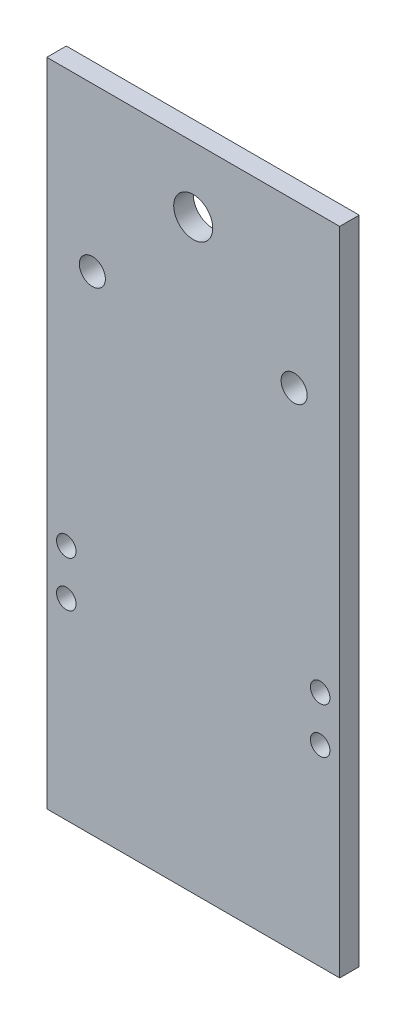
ISO-10303-21;
HEADER;
FILE_DESCRIPTION(('STEP AP214'),'2;1');
FILE_NAME('part.step','',(''),(''),'','','');
FILE_SCHEMA(('AUTOMOTIVE_DESIGN { 1 0 10303 214 1 1 1 1 }'));
ENDSEC;
DATA;
#1=APPLICATION_CONTEXT('core data for automotive mechanical design processes');
#2=APPLICATION_PROTOCOL_DEFINITION('international standard','automotive_design',2000,#1);
#3=PRODUCT_CONTEXT('',#1,'mechanical');
#4=PRODUCT('Part','Part','',(#3));
#5=PRODUCT_RELATED_PRODUCT_CATEGORY('part','',(#4));
#6=PRODUCT_DEFINITION_FORMATION('','',#4);
#7=PRODUCT_DEFINITION_CONTEXT('part definition',#1,'design');
#8=PRODUCT_DEFINITION('design','',#6,#7);
#9=PRODUCT_DEFINITION_SHAPE('','',#8);
#10=(LENGTH_UNIT() NAMED_UNIT(*) SI_UNIT(.MILLI.,.METRE.));
#11=(NAMED_UNIT(*) PLANE_ANGLE_UNIT() SI_UNIT($,.RADIAN.));
#12=(NAMED_UNIT(*) SI_UNIT($,.STERADIAN.) SOLID_ANGLE_UNIT());
#13=UNCERTAINTY_MEASURE_WITH_UNIT(LENGTH_MEASURE(1.E-05),#10,'distance_accuracy_value','');
#14=(GEOMETRIC_REPRESENTATION_CONTEXT(3) GLOBAL_UNCERTAINTY_ASSIGNED_CONTEXT((#13)) GLOBAL_UNIT_ASSIGNED_CONTEXT((#10,
#11,#12)) REPRESENTATION_CONTEXT('',''));
#15=CARTESIAN_POINT('',(0.,0.,0.));
#16=DIRECTION('',(0.,0.,1.));
#17=DIRECTION('',(1.,0.,0.));
#18=AXIS2_PLACEMENT_3D('',#15,#16,#17);
#19=CARTESIAN_POINT('',(-29.4581866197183,-73.3926056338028,3.));
#20=DIRECTION('',(0.,0.,1.));
#21=DIRECTION('',(1.,0.,0.));
#22=AXIS2_PLACEMENT_3D('',#19,#20,#21);
#23=PLANE('',#22);
#24=CARTESIAN_POINT('',(-26.4581866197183,-36.8926056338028,3.));
#25=DIRECTION('',(0.,0.,1.));
#26=DIRECTION('',(1.,0.,0.));
#27=AXIS2_PLACEMENT_3D('',#24,#25,#26);
#28=CIRCLE('',#27,1.5);
#29=CARTESIAN_POINT('',(-24.9581866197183,-36.8926056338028,3.));
#30=VERTEX_POINT('',#29);
#31=EDGE_CURVE('E134',#30,#30,#28,.T.);
#32=ORIENTED_EDGE('',*,*,#31,.F.);
#33=EDGE_LOOP('',(#32));
#34=FACE_BOUND('',#33,.T.);
#35=CARTESIAN_POINT('',(-26.4581866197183,-43.8926056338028,3.));
#36=DIRECTION('',(0.,0.,1.));
#37=DIRECTION('',(1.,0.,0.));
#38=AXIS2_PLACEMENT_3D('',#35,#36,#37);
#39=CIRCLE('',#38,1.5);
#40=CARTESIAN_POINT('',(-24.9581866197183,-43.8926056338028,3.));
#41=VERTEX_POINT('',#40);
#42=EDGE_CURVE('E148',#41,#41,#39,.T.);
#43=ORIENTED_EDGE('',*,*,#42,.F.);
#44=EDGE_LOOP('',(#43));
#45=FACE_BOUND('',#44,.T.);
#46=CARTESIAN_POINT('',(8.5418133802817,1.60739436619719,3.));
#47=DIRECTION('',(0.,0.,1.));
#48=DIRECTION('',(1.,0.,0.));
#49=AXIS2_PLACEMENT_3D('',#46,#47,#48);
#50=CIRCLE('',#49,2.);
#51=CARTESIAN_POINT('',(10.5418133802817,1.60739436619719,3.));
#52=VERTEX_POINT('',#51);
#53=EDGE_CURVE('E158',#52,#52,#50,.T.);
#54=ORIENTED_EDGE('',*,*,#53,.F.);
#55=EDGE_LOOP('',(#54));
#56=FACE_BOUND('',#55,.T.);
#57=DIRECTION('',(0.,-1.,0.));
#58=VECTOR('',#57,1.);
#59=CARTESIAN_POINT('',(-29.4581866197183,26.6073943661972,3.));
#60=LINE('',#59,#58);
#61=CARTESIAN_POINT('',(-29.4581866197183,26.6073943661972,3.));
#62=VERTEX_POINT('',#61);
#63=CARTESIAN_POINT('',(-29.4581866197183,-73.3926056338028,3.));
#64=VERTEX_POINT('',#63);
#65=EDGE_CURVE('E100',#62,#64,#60,.T.);
#66=ORIENTED_EDGE('',*,*,#65,.T.);
#67=DIRECTION('',(1.,0.,0.));
#68=VECTOR('',#67,1.);
#69=CARTESIAN_POINT('',(-29.4581866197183,-73.3926056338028,3.));
#70=LINE('',#69,#68);
#71=CARTESIAN_POINT('',(15.5418133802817,-73.3926056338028,3.));
#72=VERTEX_POINT('',#71);
#73=EDGE_CURVE('E85',#64,#72,#70,.T.);
#74=ORIENTED_EDGE('',*,*,#73,.T.);
#75=DIRECTION('',(0.,1.,0.));
#76=VECTOR('',#75,1.);
#77=CARTESIAN_POINT('',(15.5418133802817,26.6073943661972,3.));
#78=LINE('',#77,#76);
#79=CARTESIAN_POINT('',(15.5418133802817,26.6073943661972,3.));
#80=VERTEX_POINT('',#79);
#81=EDGE_CURVE('E51',#72,#80,#78,.T.);
#82=ORIENTED_EDGE('',*,*,#81,.T.);
#83=DIRECTION('',(-1.,0.,0.));
#84=VECTOR('',#83,1.);
#85=CARTESIAN_POINT('',(-29.4581866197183,26.6073943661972,3.));
#86=LINE('',#85,#84);
#87=EDGE_CURVE('E46',#80,#62,#86,.T.);
#88=ORIENTED_EDGE('',*,*,#87,.T.);
#89=EDGE_LOOP('',(#66,#74,#82,#88));
#90=FACE_BOUND('',#89,.T.);
#91=CARTESIAN_POINT('',(-6.9581866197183,16.6073943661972,3.));
#92=DIRECTION('',(0.,0.,1.));
#93=DIRECTION('',(1.,0.,0.));
#94=AXIS2_PLACEMENT_3D('',#91,#92,#93);
#95=CIRCLE('',#94,3.);
#96=CARTESIAN_POINT('',(-3.9581866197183,16.6073943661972,3.));
#97=VERTEX_POINT('',#96);
#98=EDGE_CURVE('E90',#97,#97,#95,.T.);
#99=ORIENTED_EDGE('',*,*,#98,.F.);
#100=EDGE_LOOP('',(#99));
#101=FACE_BOUND('',#100,.T.);
#102=CARTESIAN_POINT('',(-22.4581866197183,1.60739436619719,3.));
#103=DIRECTION('',(0.,0.,1.));
#104=DIRECTION('',(1.,0.,0.));
#105=AXIS2_PLACEMENT_3D('',#102,#103,#104);
#106=CIRCLE('',#105,2.);
#107=CARTESIAN_POINT('',(-20.4581866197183,1.60739436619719,3.));
#108=VERTEX_POINT('',#107);
#109=EDGE_CURVE('E121',#108,#108,#106,.T.);
#110=ORIENTED_EDGE('',*,*,#109,.F.);
#111=EDGE_LOOP('',(#110));
#112=FACE_BOUND('',#111,.T.);
#113=CARTESIAN_POINT('',(12.5418133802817,-43.8926056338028,3.));
#114=DIRECTION('',(0.,0.,1.));
#115=DIRECTION('',(1.,0.,0.));
#116=AXIS2_PLACEMENT_3D('',#113,#114,#115);
#117=CIRCLE('',#116,1.5);
#118=CARTESIAN_POINT('',(14.0418133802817,-43.8926056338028,3.));
#119=VERTEX_POINT('',#118);
#120=EDGE_CURVE('E125',#119,#119,#117,.T.);
#121=ORIENTED_EDGE('',*,*,#120,.F.);
#122=EDGE_LOOP('',(#121));
#123=FACE_BOUND('',#122,.T.);
#124=CARTESIAN_POINT('',(12.5418133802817,-36.8926056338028,3.));
#125=DIRECTION('',(0.,0.,1.));
#126=DIRECTION('',(1.,0.,0.));
#127=AXIS2_PLACEMENT_3D('',#124,#125,#126);
#128=CIRCLE('',#127,1.5);
#129=CARTESIAN_POINT('',(14.0418133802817,-36.8926056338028,3.));
#130=VERTEX_POINT('',#129);
#131=EDGE_CURVE('E128',#130,#130,#128,.T.);
#132=ORIENTED_EDGE('',*,*,#131,.F.);
#133=EDGE_LOOP('',(#132));
#134=FACE_BOUND('',#133,.T.);
#135=ADVANCED_FACE('F31',(#34,#45,#56,#90,#101,#112,#123,#134),#23,.T.);
#136=CARTESIAN_POINT('',(-29.4581866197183,-73.3926056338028,0.));
#137=DIRECTION('',(0.,0.,1.));
#138=DIRECTION('',(1.,0.,0.));
#139=AXIS2_PLACEMENT_3D('',#136,#137,#138);
#140=PLANE('',#139);
#141=CARTESIAN_POINT('',(-26.4581866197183,-36.8926056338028,0.));
#142=DIRECTION('',(0.,0.,1.));
#143=DIRECTION('',(1.,0.,0.));
#144=AXIS2_PLACEMENT_3D('',#141,#142,#143);
#145=CIRCLE('',#144,1.5);
#146=CARTESIAN_POINT('',(-24.9581866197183,-36.8926056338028,0.));
#147=VERTEX_POINT('',#146);
#148=EDGE_CURVE('E130',#147,#147,#145,.T.);
#149=ORIENTED_EDGE('',*,*,#148,.T.);
#150=EDGE_LOOP('',(#149));
#151=FACE_BOUND('',#150,.T.);
#152=CARTESIAN_POINT('',(-26.4581866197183,-43.8926056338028,0.));
#153=DIRECTION('',(0.,0.,1.));
#154=DIRECTION('',(1.,0.,0.));
#155=AXIS2_PLACEMENT_3D('',#152,#153,#154);
#156=CIRCLE('',#155,1.5);
#157=CARTESIAN_POINT('',(-24.9581866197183,-43.8926056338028,0.));
#158=VERTEX_POINT('',#157);
#159=EDGE_CURVE('E145',#158,#158,#156,.T.);
#160=ORIENTED_EDGE('',*,*,#159,.T.);
#161=EDGE_LOOP('',(#160));
#162=FACE_BOUND('',#161,.T.);
#163=CARTESIAN_POINT('',(8.5418133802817,1.60739436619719,0.));
#164=DIRECTION('',(0.,0.,1.));
#165=DIRECTION('',(1.,0.,0.));
#166=AXIS2_PLACEMENT_3D('',#163,#164,#165);
#167=CIRCLE('',#166,2.);
#168=CARTESIAN_POINT('',(10.5418133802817,1.60739436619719,0.));
#169=VERTEX_POINT('',#168);
#170=EDGE_CURVE('E155',#169,#169,#167,.T.);
#171=ORIENTED_EDGE('',*,*,#170,.T.);
#172=EDGE_LOOP('',(#171));
#173=FACE_BOUND('',#172,.T.);
#174=DIRECTION('',(0.,-1.,0.));
#175=VECTOR('',#174,1.);
#176=CARTESIAN_POINT('',(-29.4581866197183,26.6073943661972,0.));
#177=LINE('',#176,#175);
#178=CARTESIAN_POINT('',(-29.4581866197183,26.6073943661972,0.));
#179=VERTEX_POINT('',#178);
#180=CARTESIAN_POINT('',(-29.4581866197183,-73.3926056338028,0.));
#181=VERTEX_POINT('',#180);
#182=EDGE_CURVE('E77',#179,#181,#177,.T.);
#183=ORIENTED_EDGE('',*,*,#182,.F.);
#184=DIRECTION('',(-1.,0.,0.));
#185=VECTOR('',#184,1.);
#186=CARTESIAN_POINT('',(-29.4581866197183,26.6073943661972,0.));
#187=LINE('',#186,#185);
#188=CARTESIAN_POINT('',(15.5418133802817,26.6073943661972,0.));
#189=VERTEX_POINT('',#188);
#190=EDGE_CURVE('E98',#189,#179,#187,.T.);
#191=ORIENTED_EDGE('',*,*,#190,.F.);
#192=DIRECTION('',(0.,1.,0.));
#193=VECTOR('',#192,1.);
#194=CARTESIAN_POINT('',(15.5418133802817,26.6073943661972,0.));
#195=LINE('',#194,#193);
#196=CARTESIAN_POINT('',(15.5418133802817,-73.3926056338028,0.));
#197=VERTEX_POINT('',#196);
#198=EDGE_CURVE('E78',#197,#189,#195,.T.);
#199=ORIENTED_EDGE('',*,*,#198,.F.);
#200=DIRECTION('',(1.,0.,0.));
#201=VECTOR('',#200,1.);
#202=CARTESIAN_POINT('',(-29.4581866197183,-73.3926056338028,0.));
#203=LINE('',#202,#201);
#204=EDGE_CURVE('E72',#181,#197,#203,.T.);
#205=ORIENTED_EDGE('',*,*,#204,.F.);
#206=EDGE_LOOP('',(#183,#191,#199,#205));
#207=FACE_BOUND('',#206,.T.);
#208=CARTESIAN_POINT('',(-6.9581866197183,16.6073943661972,0.));
#209=DIRECTION('',(0.,0.,1.));
#210=DIRECTION('',(1.,0.,0.));
#211=AXIS2_PLACEMENT_3D('',#208,#209,#210);
#212=CIRCLE('',#211,3.);
#213=CARTESIAN_POINT('',(-3.9581866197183,16.6073943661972,0.));
#214=VERTEX_POINT('',#213);
#215=EDGE_CURVE('E93',#214,#214,#212,.T.);
#216=ORIENTED_EDGE('',*,*,#215,.T.);
#217=EDGE_LOOP('',(#216));
#218=FACE_BOUND('',#217,.T.);
#219=CARTESIAN_POINT('',(-22.4581866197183,1.60739436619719,0.));
#220=DIRECTION('',(0.,0.,1.));
#221=DIRECTION('',(1.,0.,0.));
#222=AXIS2_PLACEMENT_3D('',#219,#220,#221);
#223=CIRCLE('',#222,2.);
#224=CARTESIAN_POINT('',(-20.4581866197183,1.60739436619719,0.));
#225=VERTEX_POINT('',#224);
#226=EDGE_CURVE('E151',#225,#225,#223,.T.);
#227=ORIENTED_EDGE('',*,*,#226,.T.);
#228=EDGE_LOOP('',(#227));
#229=FACE_BOUND('',#228,.T.);
#230=CARTESIAN_POINT('',(12.5418133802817,-43.8926056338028,0.));
#231=DIRECTION('',(0.,0.,1.));
#232=DIRECTION('',(1.,0.,0.));
#233=AXIS2_PLACEMENT_3D('',#230,#231,#232);
#234=CIRCLE('',#233,1.5);
#235=CARTESIAN_POINT('',(14.0418133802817,-43.8926056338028,0.));
#236=VERTEX_POINT('',#235);
#237=EDGE_CURVE('E141',#236,#236,#234,.T.);
#238=ORIENTED_EDGE('',*,*,#237,.T.);
#239=EDGE_LOOP('',(#238));
#240=FACE_BOUND('',#239,.T.);
#241=CARTESIAN_POINT('',(12.5418133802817,-36.8926056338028,0.));
#242=DIRECTION('',(0.,0.,1.));
#243=DIRECTION('',(1.,0.,0.));
#244=AXIS2_PLACEMENT_3D('',#241,#242,#243);
#245=CIRCLE('',#244,1.5);
#246=CARTESIAN_POINT('',(14.0418133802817,-36.8926056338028,0.));
#247=VERTEX_POINT('',#246);
#248=EDGE_CURVE('E131',#247,#247,#245,.T.);
#249=ORIENTED_EDGE('',*,*,#248,.T.);
#250=EDGE_LOOP('',(#249));
#251=FACE_BOUND('',#250,.T.);
#252=ADVANCED_FACE('F73',(#151,#162,#173,#207,#218,#229,#240,#251),#140,.F.);
#253=CARTESIAN_POINT('',(-29.4581866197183,26.6073943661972,3.));
#254=DIRECTION('',(1.,0.,0.));
#255=DIRECTION('',(0.,1.,0.));
#256=AXIS2_PLACEMENT_3D('',#253,#254,#255);
#257=PLANE('',#256);
#258=ORIENTED_EDGE('',*,*,#182,.T.);
#259=DIRECTION('',(0.,0.,-1.));
#260=VECTOR('',#259,1.);
#261=CARTESIAN_POINT('',(-29.4581866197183,-73.3926056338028,3.));
#262=LINE('',#261,#260);
#263=EDGE_CURVE('E11',#64,#181,#262,.T.);
#264=ORIENTED_EDGE('',*,*,#263,.F.);
#265=ORIENTED_EDGE('',*,*,#65,.F.);
#266=DIRECTION('',(0.,0.,-1.));
#267=VECTOR('',#266,1.);
#268=CARTESIAN_POINT('',(-29.4581866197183,26.6073943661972,3.));
#269=LINE('',#268,#267);
#270=EDGE_CURVE('E89',#62,#179,#269,.T.);
#271=ORIENTED_EDGE('',*,*,#270,.T.);
#272=EDGE_LOOP('',(#258,#264,#265,#271));
#273=FACE_BOUND('',#272,.T.);
#274=ADVANCED_FACE('F33',(#273),#257,.F.);
#275=CARTESIAN_POINT('',(-29.4581866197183,-73.3926056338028,3.));
#276=DIRECTION('',(0.,1.,0.));
#277=DIRECTION('',(0.,0.,1.));
#278=AXIS2_PLACEMENT_3D('',#275,#276,#277);
#279=PLANE('',#278);
#280=ORIENTED_EDGE('',*,*,#204,.T.);
#281=DIRECTION('',(0.,0.,-1.));
#282=VECTOR('',#281,1.);
#283=CARTESIAN_POINT('',(15.5418133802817,-73.3926056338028,3.));
#284=LINE('',#283,#282);
#285=EDGE_CURVE('E39',#72,#197,#284,.T.);
#286=ORIENTED_EDGE('',*,*,#285,.F.);
#287=ORIENTED_EDGE('',*,*,#73,.F.);
#288=ORIENTED_EDGE('',*,*,#263,.T.);
#289=EDGE_LOOP('',(#280,#286,#287,#288));
#290=FACE_BOUND('',#289,.T.);
#291=ADVANCED_FACE('F84',(#290),#279,.F.);
#292=CARTESIAN_POINT('',(15.5418133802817,26.6073943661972,3.));
#293=DIRECTION('',(-1.,0.,0.));
#294=DIRECTION('',(0.,-1.,0.));
#295=AXIS2_PLACEMENT_3D('',#292,#293,#294);
#296=PLANE('',#295);
#297=ORIENTED_EDGE('',*,*,#198,.T.);
#298=DIRECTION('',(0.,0.,-1.));
#299=VECTOR('',#298,1.);
#300=CARTESIAN_POINT('',(15.5418133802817,26.6073943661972,3.));
#301=LINE('',#300,#299);
#302=EDGE_CURVE('E106',#80,#189,#301,.T.);
#303=ORIENTED_EDGE('',*,*,#302,.F.);
#304=ORIENTED_EDGE('',*,*,#81,.F.);
#305=ORIENTED_EDGE('',*,*,#285,.T.);
#306=EDGE_LOOP('',(#297,#303,#304,#305));
#307=FACE_BOUND('',#306,.T.);
#308=ADVANCED_FACE('F109',(#307),#296,.F.);
#309=CARTESIAN_POINT('',(-29.4581866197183,26.6073943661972,3.));
#310=DIRECTION('',(0.,-1.,0.));
#311=DIRECTION('',(0.,0.,-1.));
#312=AXIS2_PLACEMENT_3D('',#309,#310,#311);
#313=PLANE('',#312);
#314=ORIENTED_EDGE('',*,*,#190,.T.);
#315=ORIENTED_EDGE('',*,*,#270,.F.);
#316=ORIENTED_EDGE('',*,*,#87,.F.);
#317=ORIENTED_EDGE('',*,*,#302,.T.);
#318=EDGE_LOOP('',(#314,#315,#316,#317));
#319=FACE_BOUND('',#318,.T.);
#320=ADVANCED_FACE('F111',(#319),#313,.F.);
#321=CARTESIAN_POINT('',(-6.9581866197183,16.6073943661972,3.));
#322=DIRECTION('',(0.,0.,-1.));
#323=DIRECTION('',(-1.,0.,0.));
#324=AXIS2_PLACEMENT_3D('',#321,#322,#323);
#325=CYLINDRICAL_SURFACE('',#324,3.);
#326=ORIENTED_EDGE('',*,*,#98,.T.);
#327=EDGE_LOOP('',(#326));
#328=FACE_BOUND('',#327,.T.);
#329=ORIENTED_EDGE('',*,*,#215,.F.);
#330=EDGE_LOOP('',(#329));
#331=FACE_BOUND('',#330,.T.);
#332=ADVANCED_FACE('F164',(#328,#331),#325,.F.);
#333=CARTESIAN_POINT('',(8.5418133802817,1.60739436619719,3.));
#334=DIRECTION('',(0.,0.,-1.));
#335=DIRECTION('',(-1.,0.,0.));
#336=AXIS2_PLACEMENT_3D('',#333,#334,#335);
#337=CYLINDRICAL_SURFACE('',#336,2.);
#338=ORIENTED_EDGE('',*,*,#53,.T.);
#339=EDGE_LOOP('',(#338));
#340=FACE_BOUND('',#339,.T.);
#341=ORIENTED_EDGE('',*,*,#170,.F.);
#342=EDGE_LOOP('',(#341));
#343=FACE_BOUND('',#342,.T.);
#344=ADVANCED_FACE('F166',(#340,#343),#337,.F.);
#345=CARTESIAN_POINT('',(-22.4581866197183,1.60739436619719,3.));
#346=DIRECTION('',(0.,0.,-1.));
#347=DIRECTION('',(-1.,0.,0.));
#348=AXIS2_PLACEMENT_3D('',#345,#346,#347);
#349=CYLINDRICAL_SURFACE('',#348,2.);
#350=ORIENTED_EDGE('',*,*,#109,.T.);
#351=EDGE_LOOP('',(#350));
#352=FACE_BOUND('',#351,.T.);
#353=ORIENTED_EDGE('',*,*,#226,.F.);
#354=EDGE_LOOP('',(#353));
#355=FACE_BOUND('',#354,.T.);
#356=ADVANCED_FACE('F173',(#352,#355),#349,.F.);
#357=CARTESIAN_POINT('',(-26.4581866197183,-43.8926056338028,3.));
#358=DIRECTION('',(0.,0.,-1.));
#359=DIRECTION('',(-1.,0.,0.));
#360=AXIS2_PLACEMENT_3D('',#357,#358,#359);
#361=CYLINDRICAL_SURFACE('',#360,1.5);
#362=ORIENTED_EDGE('',*,*,#42,.T.);
#363=EDGE_LOOP('',(#362));
#364=FACE_BOUND('',#363,.T.);
#365=ORIENTED_EDGE('',*,*,#159,.F.);
#366=EDGE_LOOP('',(#365));
#367=FACE_BOUND('',#366,.T.);
#368=ADVANCED_FACE('F220',(#364,#367),#361,.F.);
#369=CARTESIAN_POINT('',(12.5418133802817,-43.8926056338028,3.));
#370=DIRECTION('',(0.,0.,-1.));
#371=DIRECTION('',(-1.,0.,0.));
#372=AXIS2_PLACEMENT_3D('',#369,#370,#371);
#373=CYLINDRICAL_SURFACE('',#372,1.5);
#374=ORIENTED_EDGE('',*,*,#120,.T.);
#375=EDGE_LOOP('',(#374));
#376=FACE_BOUND('',#375,.T.);
#377=ORIENTED_EDGE('',*,*,#237,.F.);
#378=EDGE_LOOP('',(#377));
#379=FACE_BOUND('',#378,.T.);
#380=ADVANCED_FACE('F227',(#376,#379),#373,.F.);
#381=CARTESIAN_POINT('',(-26.4581866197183,-36.8926056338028,3.));
#382=DIRECTION('',(0.,0.,-1.));
#383=DIRECTION('',(-1.,0.,0.));
#384=AXIS2_PLACEMENT_3D('',#381,#382,#383);
#385=CYLINDRICAL_SURFACE('',#384,1.5);
#386=ORIENTED_EDGE('',*,*,#31,.T.);
#387=EDGE_LOOP('',(#386));
#388=FACE_BOUND('',#387,.T.);
#389=ORIENTED_EDGE('',*,*,#148,.F.);
#390=EDGE_LOOP('',(#389));
#391=FACE_BOUND('',#390,.T.);
#392=ADVANCED_FACE('F235',(#388,#391),#385,.F.);
#393=CARTESIAN_POINT('',(12.5418133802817,-36.8926056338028,3.));
#394=DIRECTION('',(0.,0.,-1.));
#395=DIRECTION('',(-1.,0.,0.));
#396=AXIS2_PLACEMENT_3D('',#393,#394,#395);
#397=CYLINDRICAL_SURFACE('',#396,1.5);
#398=ORIENTED_EDGE('',*,*,#131,.T.);
#399=EDGE_LOOP('',(#398));
#400=FACE_BOUND('',#399,.T.);
#401=ORIENTED_EDGE('',*,*,#248,.F.);
#402=EDGE_LOOP('',(#401));
#403=FACE_BOUND('',#402,.T.);
#404=ADVANCED_FACE('F243',(#400,#403),#397,.F.);
#405=CLOSED_SHELL('',(#135,#252,#274,#291,#308,#320,#332,#344,#356,#368,#380,#392,#404));
#406=MANIFOLD_SOLID_BREP('B2',#405);
#407=ADVANCED_BREP_SHAPE_REPRESENTATION('',(#18,#406),#14);
#408=SHAPE_DEFINITION_REPRESENTATION(#9,#407);
ENDSEC;
END-ISO-10303-21;
